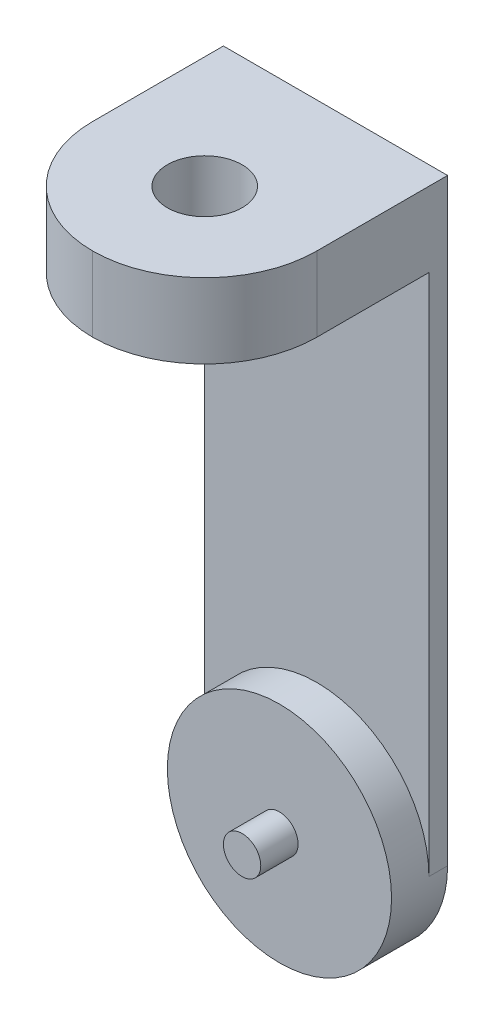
ISO-10303-21;
HEADER;
FILE_DESCRIPTION(('STEP AP214'),'2;1');
FILE_NAME('part.step','',(''),(''),'','','');
FILE_SCHEMA(('AUTOMOTIVE_DESIGN { 1 0 10303 214 1 1 1 1 }'));
ENDSEC;
DATA;
#1=APPLICATION_CONTEXT('core data for automotive mechanical design processes');
#2=APPLICATION_PROTOCOL_DEFINITION('international standard','automotive_design',2000,#1);
#3=PRODUCT_CONTEXT('',#1,'mechanical');
#4=PRODUCT('Part','Part','',(#3));
#5=PRODUCT_RELATED_PRODUCT_CATEGORY('part','',(#4));
#6=PRODUCT_DEFINITION_FORMATION('','',#4);
#7=PRODUCT_DEFINITION_CONTEXT('part definition',#1,'design');
#8=PRODUCT_DEFINITION('design','',#6,#7);
#9=PRODUCT_DEFINITION_SHAPE('','',#8);
#10=(LENGTH_UNIT() NAMED_UNIT(*) SI_UNIT(.MILLI.,.METRE.));
#11=(NAMED_UNIT(*) PLANE_ANGLE_UNIT() SI_UNIT($,.RADIAN.));
#12=(NAMED_UNIT(*) SI_UNIT($,.STERADIAN.) SOLID_ANGLE_UNIT());
#13=UNCERTAINTY_MEASURE_WITH_UNIT(LENGTH_MEASURE(1.E-05),#10,'distance_accuracy_value','');
#14=(GEOMETRIC_REPRESENTATION_CONTEXT(3) GLOBAL_UNCERTAINTY_ASSIGNED_CONTEXT((#13)) GLOBAL_UNIT_ASSIGNED_CONTEXT((#10,
#11,#12)) REPRESENTATION_CONTEXT('',''));
#15=CARTESIAN_POINT('',(0.,0.,0.));
#16=DIRECTION('',(0.,0.,1.));
#17=DIRECTION('',(1.,0.,0.));
#18=AXIS2_PLACEMENT_3D('',#15,#16,#17);
#19=CARTESIAN_POINT('',(0.,0.,5.));
#20=DIRECTION('',(0.,0.,-1.));
#21=DIRECTION('',(-1.,0.,0.));
#22=AXIS2_PLACEMENT_3D('',#19,#20,#21);
#23=PLANE('',#22);
#24=DIRECTION('',(-1.,0.,0.));
#25=VECTOR('',#24,1.);
#26=CARTESIAN_POINT('',(0.,140.,5.));
#27=LINE('',#26,#25);
#28=CARTESIAN_POINT('',(60.,140.,5.));
#29=VERTEX_POINT('',#28);
#30=CARTESIAN_POINT('',(0.,140.,5.));
#31=VERTEX_POINT('',#30);
#32=EDGE_CURVE('E125',#29,#31,#27,.T.);
#33=ORIENTED_EDGE('',*,*,#32,.T.);
#34=DIRECTION('',(0.,-1.,0.));
#35=VECTOR('',#34,1.);
#36=CARTESIAN_POINT('',(0.,0.,5.));
#37=LINE('',#36,#35);
#38=CARTESIAN_POINT('',(0.,0.,5.));
#39=VERTEX_POINT('',#38);
#40=EDGE_CURVE('E115',#31,#39,#37,.T.);
#41=ORIENTED_EDGE('',*,*,#40,.T.);
#42=CARTESIAN_POINT('',(30.,0.,5.));
#43=DIRECTION('',(0.,0.,1.));
#44=DIRECTION('',(1.,0.,0.));
#45=AXIS2_PLACEMENT_3D('',#42,#43,#44);
#46=CIRCLE('',#45,30.);
#47=CARTESIAN_POINT('',(60.,0.,5.));
#48=VERTEX_POINT('',#47);
#49=EDGE_CURVE('E98',#48,#39,#46,.T.);
#50=ORIENTED_EDGE('',*,*,#49,.F.);
#51=DIRECTION('',(0.,1.,0.));
#52=VECTOR('',#51,1.);
#53=CARTESIAN_POINT('',(60.,0.,5.));
#54=LINE('',#53,#52);
#55=EDGE_CURVE('E107',#48,#29,#54,.T.);
#56=ORIENTED_EDGE('',*,*,#55,.T.);
#57=EDGE_LOOP('',(#33,#41,#50,#56));
#58=FACE_BOUND('',#57,.T.);
#59=ADVANCED_FACE('F33',(#58),#23,.F.);
#60=CARTESIAN_POINT('',(0.,0.,5.));
#61=DIRECTION('',(1.,0.,0.));
#62=DIRECTION('',(0.,0.,-1.));
#63=AXIS2_PLACEMENT_3D('',#60,#61,#62);
#64=PLANE('',#63);
#65=DIRECTION('',(0.,0.,1.));
#66=VECTOR('',#65,1.);
#67=CARTESIAN_POINT('',(0.,140.,5.));
#68=LINE('',#67,#66);
#69=CARTESIAN_POINT('',(0.,140.,35.));
#70=VERTEX_POINT('',#69);
#71=EDGE_CURVE('E152',#31,#70,#68,.T.);
#72=ORIENTED_EDGE('',*,*,#71,.T.);
#73=DIRECTION('',(0.,1.,0.));
#74=VECTOR('',#73,1.);
#75=CARTESIAN_POINT('',(0.,160.,35.));
#76=LINE('',#75,#74);
#77=CARTESIAN_POINT('',(0.,160.,35.));
#78=VERTEX_POINT('',#77);
#79=EDGE_CURVE('E41',#70,#78,#76,.T.);
#80=ORIENTED_EDGE('',*,*,#79,.T.);
#81=DIRECTION('',(0.,0.,-1.));
#82=VECTOR('',#81,1.);
#83=CARTESIAN_POINT('',(0.,160.,5.));
#84=LINE('',#83,#82);
#85=CARTESIAN_POINT('',(0.,160.,0.));
#86=VERTEX_POINT('',#85);
#87=EDGE_CURVE('E114',#78,#86,#84,.T.);
#88=ORIENTED_EDGE('',*,*,#87,.T.);
#89=DIRECTION('',(0.,-1.,0.));
#90=VECTOR('',#89,1.);
#91=CARTESIAN_POINT('',(0.,0.,0.));
#92=LINE('',#91,#90);
#93=CARTESIAN_POINT('',(0.,0.,0.));
#94=VERTEX_POINT('',#93);
#95=EDGE_CURVE('E130',#86,#94,#92,.T.);
#96=ORIENTED_EDGE('',*,*,#95,.T.);
#97=DIRECTION('',(0.,0.,-1.));
#98=VECTOR('',#97,1.);
#99=CARTESIAN_POINT('',(0.,0.,5.));
#100=LINE('',#99,#98);
#101=EDGE_CURVE('E103',#39,#94,#100,.T.);
#102=ORIENTED_EDGE('',*,*,#101,.F.);
#103=ORIENTED_EDGE('',*,*,#40,.F.);
#104=EDGE_LOOP('',(#72,#80,#88,#96,#102,#103));
#105=FACE_BOUND('',#104,.T.);
#106=ADVANCED_FACE('F190',(#105),#64,.F.);
#107=CARTESIAN_POINT('',(60.,0.,5.));
#108=DIRECTION('',(-1.,0.,0.));
#109=DIRECTION('',(0.,0.,1.));
#110=AXIS2_PLACEMENT_3D('',#107,#108,#109);
#111=PLANE('',#110);
#112=DIRECTION('',(0.,0.,-1.));
#113=VECTOR('',#112,1.);
#114=CARTESIAN_POINT('',(60.,160.,5.));
#115=LINE('',#114,#113);
#116=CARTESIAN_POINT('',(60.,160.,35.));
#117=VERTEX_POINT('',#116);
#118=CARTESIAN_POINT('',(60.,160.,0.));
#119=VERTEX_POINT('',#118);
#120=EDGE_CURVE('E104',#117,#119,#115,.T.);
#121=ORIENTED_EDGE('',*,*,#120,.F.);
#122=DIRECTION('',(0.,1.,0.));
#123=VECTOR('',#122,1.);
#124=CARTESIAN_POINT('',(60.,140.,35.));
#125=LINE('',#124,#123);
#126=CARTESIAN_POINT('',(60.,140.,35.));
#127=VERTEX_POINT('',#126);
#128=EDGE_CURVE('E146',#117,#127,#125,.F.);
#129=ORIENTED_EDGE('',*,*,#128,.T.);
#130=DIRECTION('',(0.,0.,-1.));
#131=VECTOR('',#130,1.);
#132=CARTESIAN_POINT('',(60.,140.,5.));
#133=LINE('',#132,#131);
#134=EDGE_CURVE('E111',#127,#29,#133,.T.);
#135=ORIENTED_EDGE('',*,*,#134,.T.);
#136=ORIENTED_EDGE('',*,*,#55,.F.);
#137=DIRECTION('',(0.,0.,-1.));
#138=VECTOR('',#137,1.);
#139=CARTESIAN_POINT('',(60.,0.,5.));
#140=LINE('',#139,#138);
#141=CARTESIAN_POINT('',(60.,0.,0.));
#142=VERTEX_POINT('',#141);
#143=EDGE_CURVE('E92',#48,#142,#140,.T.);
#144=ORIENTED_EDGE('',*,*,#143,.T.);
#145=DIRECTION('',(0.,1.,0.));
#146=VECTOR('',#145,1.);
#147=CARTESIAN_POINT('',(60.,0.,0.));
#148=LINE('',#147,#146);
#149=EDGE_CURVE('E134',#142,#119,#148,.T.);
#150=ORIENTED_EDGE('',*,*,#149,.T.);
#151=EDGE_LOOP('',(#121,#129,#135,#136,#144,#150));
#152=FACE_BOUND('',#151,.T.);
#153=ADVANCED_FACE('F109',(#152),#111,.F.);
#154=CARTESIAN_POINT('',(0.,160.,5.));
#155=DIRECTION('',(0.,-1.,0.));
#156=DIRECTION('',(0.,0.,-1.));
#157=AXIS2_PLACEMENT_3D('',#154,#155,#156);
#158=PLANE('',#157);
#159=CARTESIAN_POINT('',(30.,160.,35.));
#160=DIRECTION('',(0.,1.,0.));
#161=DIRECTION('',(0.,0.,1.));
#162=AXIS2_PLACEMENT_3D('',#159,#160,#161);
#163=CIRCLE('',#162,10.);
#164=CARTESIAN_POINT('',(30.,160.,45.));
#165=VERTEX_POINT('',#164);
#166=EDGE_CURVE('E159',#165,#165,#163,.T.);
#167=ORIENTED_EDGE('',*,*,#166,.F.);
#168=EDGE_LOOP('',(#167));
#169=FACE_BOUND('',#168,.T.);
#170=CARTESIAN_POINT('',(30.,160.,35.));
#171=DIRECTION('',(0.,-1.,0.));
#172=DIRECTION('',(0.,0.,-1.));
#173=AXIS2_PLACEMENT_3D('',#170,#171,#172);
#174=CIRCLE('',#173,30.);
#175=CARTESIAN_POINT('',(30.,160.,65.));
#176=VERTEX_POINT('',#175);
#177=EDGE_CURVE('E142',#78,#176,#174,.F.);
#178=ORIENTED_EDGE('',*,*,#177,.T.);
#179=CARTESIAN_POINT('',(30.,160.,35.));
#180=DIRECTION('',(0.,-1.,0.));
#181=DIRECTION('',(0.,0.,-1.));
#182=AXIS2_PLACEMENT_3D('',#179,#180,#181);
#183=CIRCLE('',#182,30.);
#184=EDGE_CURVE('E144',#176,#117,#183,.F.);
#185=ORIENTED_EDGE('',*,*,#184,.T.);
#186=ORIENTED_EDGE('',*,*,#120,.T.);
#187=DIRECTION('',(-1.,0.,0.));
#188=VECTOR('',#187,1.);
#189=CARTESIAN_POINT('',(0.,160.,0.));
#190=LINE('',#189,#188);
#191=EDGE_CURVE('E131',#119,#86,#190,.T.);
#192=ORIENTED_EDGE('',*,*,#191,.T.);
#193=ORIENTED_EDGE('',*,*,#87,.F.);
#194=EDGE_LOOP('',(#178,#185,#186,#192,#193));
#195=FACE_BOUND('',#194,.T.);
#196=ADVANCED_FACE('F185',(#169,#195),#158,.F.);
#197=CARTESIAN_POINT('',(0.,0.,0.));
#198=DIRECTION('',(0.,0.,-1.));
#199=DIRECTION('',(-1.,0.,0.));
#200=AXIS2_PLACEMENT_3D('',#197,#198,#199);
#201=PLANE('',#200);
#202=ORIENTED_EDGE('',*,*,#95,.F.);
#203=ORIENTED_EDGE('',*,*,#191,.F.);
#204=ORIENTED_EDGE('',*,*,#149,.F.);
#205=CARTESIAN_POINT('',(30.,0.,0.));
#206=DIRECTION('',(0.,0.,1.));
#207=DIRECTION('',(1.,0.,0.));
#208=AXIS2_PLACEMENT_3D('',#205,#206,#207);
#209=CIRCLE('',#208,30.);
#210=EDGE_CURVE('E100',#94,#142,#209,.T.);
#211=ORIENTED_EDGE('',*,*,#210,.F.);
#212=EDGE_LOOP('',(#202,#203,#204,#211));
#213=FACE_BOUND('',#212,.T.);
#214=ADVANCED_FACE('F180',(#213),#201,.T.);
#215=CARTESIAN_POINT('',(30.,0.,5.));
#216=DIRECTION('',(0.,0.,-1.));
#217=DIRECTION('',(-1.,0.,0.));
#218=AXIS2_PLACEMENT_3D('',#215,#216,#217);
#219=CYLINDRICAL_SURFACE('',#218,30.);
#220=ORIENTED_EDGE('',*,*,#210,.T.);
#221=ORIENTED_EDGE('',*,*,#143,.F.);
#222=ORIENTED_EDGE('',*,*,#49,.T.);
#223=ORIENTED_EDGE('',*,*,#101,.T.);
#224=EDGE_LOOP('',(#220,#221,#222,#223));
#225=FACE_BOUND('',#224,.T.);
#226=CARTESIAN_POINT('',(30.,0.,15.));
#227=DIRECTION('',(0.,0.,1.));
#228=DIRECTION('',(1.,0.,0.));
#229=AXIS2_PLACEMENT_3D('',#226,#227,#228);
#230=CIRCLE('',#229,30.);
#231=CARTESIAN_POINT('',(60.,0.,15.));
#232=VERTEX_POINT('',#231);
#233=EDGE_CURVE('E119',#232,#232,#230,.T.);
#234=ORIENTED_EDGE('',*,*,#233,.F.);
#235=EDGE_LOOP('',(#234));
#236=FACE_BOUND('',#235,.T.);
#237=ADVANCED_FACE('F94',(#225,#236),#219,.T.);
#238=CARTESIAN_POINT('',(30.,0.,15.));
#239=DIRECTION('',(0.,0.,1.));
#240=DIRECTION('',(1.,0.,0.));
#241=AXIS2_PLACEMENT_3D('',#238,#239,#240);
#242=PLANE('',#241);
#243=CARTESIAN_POINT('',(30.,0.,15.));
#244=DIRECTION('',(0.,0.,1.));
#245=DIRECTION('',(1.,0.,0.));
#246=AXIS2_PLACEMENT_3D('',#243,#244,#245);
#247=CIRCLE('',#246,5.);
#248=CARTESIAN_POINT('',(35.,0.,15.));
#249=VERTEX_POINT('',#248);
#250=EDGE_CURVE('E141',#249,#249,#247,.T.);
#251=ORIENTED_EDGE('',*,*,#250,.F.);
#252=EDGE_LOOP('',(#251));
#253=FACE_BOUND('',#252,.T.);
#254=ORIENTED_EDGE('',*,*,#233,.T.);
#255=EDGE_LOOP('',(#254));
#256=FACE_BOUND('',#255,.T.);
#257=ADVANCED_FACE('F174',(#253,#256),#242,.T.);
#258=CARTESIAN_POINT('',(30.,0.,25.));
#259=DIRECTION('',(0.,0.,-1.));
#260=DIRECTION('',(-1.,0.,0.));
#261=AXIS2_PLACEMENT_3D('',#258,#259,#260);
#262=CYLINDRICAL_SURFACE('',#261,5.);
#263=CARTESIAN_POINT('',(30.,0.,25.));
#264=DIRECTION('',(0.,0.,1.));
#265=DIRECTION('',(1.,0.,0.));
#266=AXIS2_PLACEMENT_3D('',#263,#264,#265);
#267=CIRCLE('',#266,5.);
#268=CARTESIAN_POINT('',(35.,0.,25.));
#269=VERTEX_POINT('',#268);
#270=EDGE_CURVE('E120',#269,#269,#267,.T.);
#271=ORIENTED_EDGE('',*,*,#270,.F.);
#272=EDGE_LOOP('',(#271));
#273=FACE_BOUND('',#272,.T.);
#274=ORIENTED_EDGE('',*,*,#250,.T.);
#275=EDGE_LOOP('',(#274));
#276=FACE_BOUND('',#275,.T.);
#277=ADVANCED_FACE('F172',(#273,#276),#262,.T.);
#278=CARTESIAN_POINT('',(30.,0.,25.));
#279=DIRECTION('',(0.,0.,1.));
#280=DIRECTION('',(1.,0.,0.));
#281=AXIS2_PLACEMENT_3D('',#278,#279,#280);
#282=PLANE('',#281);
#283=ORIENTED_EDGE('',*,*,#270,.T.);
#284=EDGE_LOOP('',(#283));
#285=FACE_BOUND('',#284,.T.);
#286=ADVANCED_FACE('F221',(#285),#282,.T.);
#287=CARTESIAN_POINT('',(0.,140.,0.));
#288=DIRECTION('',(0.,1.,0.));
#289=DIRECTION('',(0.,0.,1.));
#290=AXIS2_PLACEMENT_3D('',#287,#288,#289);
#291=PLANE('',#290);
#292=CARTESIAN_POINT('',(30.,140.,55.));
#293=DIRECTION('',(0.,1.,0.));
#294=DIRECTION('',(0.,0.,1.));
#295=AXIS2_PLACEMENT_3D('',#292,#293,#294);
#296=CIRCLE('',#295,2.5);
#297=CARTESIAN_POINT('',(30.,140.,57.5));
#298=VERTEX_POINT('',#297);
#299=EDGE_CURVE('E11',#298,#298,#296,.F.);
#300=ORIENTED_EDGE('',*,*,#299,.F.);
#301=EDGE_LOOP('',(#300));
#302=FACE_BOUND('',#301,.T.);
#303=CARTESIAN_POINT('',(30.,140.,35.));
#304=DIRECTION('',(0.,1.,0.));
#305=DIRECTION('',(0.,0.,1.));
#306=AXIS2_PLACEMENT_3D('',#303,#304,#305);
#307=CIRCLE('',#306,10.);
#308=CARTESIAN_POINT('',(30.,140.,45.));
#309=VERTEX_POINT('',#308);
#310=EDGE_CURVE('E153',#309,#309,#307,.F.);
#311=ORIENTED_EDGE('',*,*,#310,.F.);
#312=EDGE_LOOP('',(#311));
#313=FACE_BOUND('',#312,.T.);
#314=ORIENTED_EDGE('',*,*,#134,.F.);
#315=CARTESIAN_POINT('',(30.,140.,35.));
#316=DIRECTION('',(0.,1.,0.));
#317=DIRECTION('',(0.,0.,1.));
#318=AXIS2_PLACEMENT_3D('',#315,#316,#317);
#319=CIRCLE('',#318,30.);
#320=CARTESIAN_POINT('',(30.,140.,65.));
#321=VERTEX_POINT('',#320);
#322=EDGE_CURVE('E48',#127,#321,#319,.F.);
#323=ORIENTED_EDGE('',*,*,#322,.T.);
#324=CARTESIAN_POINT('',(30.,140.,35.));
#325=DIRECTION('',(0.,1.,0.));
#326=DIRECTION('',(0.,0.,1.));
#327=AXIS2_PLACEMENT_3D('',#324,#325,#326);
#328=CIRCLE('',#327,30.);
#329=EDGE_CURVE('E52',#321,#70,#328,.F.);
#330=ORIENTED_EDGE('',*,*,#329,.T.);
#331=ORIENTED_EDGE('',*,*,#71,.F.);
#332=ORIENTED_EDGE('',*,*,#32,.F.);
#333=EDGE_LOOP('',(#314,#323,#330,#331,#332));
#334=FACE_BOUND('',#333,.T.);
#335=ADVANCED_FACE('F211',(#302,#313,#334),#291,.F.);
#336=CARTESIAN_POINT('',(30.,0.,35.));
#337=DIRECTION('',(0.,-1.,0.));
#338=DIRECTION('',(0.,0.,-1.));
#339=AXIS2_PLACEMENT_3D('',#336,#337,#338);
#340=CYLINDRICAL_SURFACE('',#339,30.);
#341=ORIENTED_EDGE('',*,*,#79,.F.);
#342=ORIENTED_EDGE('',*,*,#329,.F.);
#343=DIRECTION('',(0.,1.,0.));
#344=VECTOR('',#343,1.);
#345=CARTESIAN_POINT('',(30.,140.,65.));
#346=LINE('',#345,#344);
#347=EDGE_CURVE('E150',#176,#321,#346,.F.);
#348=ORIENTED_EDGE('',*,*,#347,.F.);
#349=ORIENTED_EDGE('',*,*,#177,.F.);
#350=EDGE_LOOP('',(#341,#342,#348,#349));
#351=FACE_BOUND('',#350,.T.);
#352=ADVANCED_FACE('F35',(#351),#340,.T.);
#353=CARTESIAN_POINT('',(30.,140.,35.));
#354=DIRECTION('',(0.,-1.,0.));
#355=DIRECTION('',(0.,0.,-1.));
#356=AXIS2_PLACEMENT_3D('',#353,#354,#355);
#357=CYLINDRICAL_SURFACE('',#356,30.);
#358=ORIENTED_EDGE('',*,*,#322,.F.);
#359=ORIENTED_EDGE('',*,*,#128,.F.);
#360=ORIENTED_EDGE('',*,*,#184,.F.);
#361=ORIENTED_EDGE('',*,*,#347,.T.);
#362=EDGE_LOOP('',(#358,#359,#360,#361));
#363=FACE_BOUND('',#362,.T.);
#364=ADVANCED_FACE('F201',(#363),#357,.T.);
#365=CARTESIAN_POINT('',(30.,-30.001,35.));
#366=DIRECTION('',(0.,1.,0.));
#367=DIRECTION('',(0.,0.,1.));
#368=AXIS2_PLACEMENT_3D('',#365,#366,#367);
#369=CYLINDRICAL_SURFACE('',#368,10.);
#370=CARTESIAN_POINT('',(30.,160.,45.));
#371=CARTESIAN_POINT('',(30.,159.791666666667,45.));
#372=CARTESIAN_POINT('',(30.,159.583333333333,45.));
#373=CARTESIAN_POINT('',(30.,159.166666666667,45.));
#374=CARTESIAN_POINT('',(30.,158.958333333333,45.));
#375=CARTESIAN_POINT('',(30.,158.541666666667,45.));
#376=CARTESIAN_POINT('',(30.,158.333333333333,45.));
#377=CARTESIAN_POINT('',(30.,157.916666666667,45.));
#378=CARTESIAN_POINT('',(30.,157.708333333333,45.));
#379=CARTESIAN_POINT('',(30.,157.291666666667,45.));
#380=CARTESIAN_POINT('',(30.,157.083333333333,45.));
#381=CARTESIAN_POINT('',(30.,156.666666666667,45.));
#382=CARTESIAN_POINT('',(30.,156.458333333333,45.));
#383=CARTESIAN_POINT('',(30.,156.041666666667,45.));
#384=CARTESIAN_POINT('',(30.,155.833333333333,45.));
#385=CARTESIAN_POINT('',(30.,155.416666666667,45.));
#386=CARTESIAN_POINT('',(30.,155.208333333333,45.));
#387=CARTESIAN_POINT('',(30.,154.791666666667,45.));
#388=CARTESIAN_POINT('',(30.,154.583333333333,45.));
#389=CARTESIAN_POINT('',(30.,154.166666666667,45.));
#390=CARTESIAN_POINT('',(30.,153.958333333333,45.));
#391=CARTESIAN_POINT('',(30.,153.541666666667,45.));
#392=CARTESIAN_POINT('',(30.,153.333333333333,45.));
#393=CARTESIAN_POINT('',(30.,152.916666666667,45.));
#394=CARTESIAN_POINT('',(30.,152.708333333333,45.));
#395=CARTESIAN_POINT('',(30.,152.291666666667,45.));
#396=CARTESIAN_POINT('',(30.,152.083333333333,45.));
#397=CARTESIAN_POINT('',(30.,151.666666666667,45.));
#398=CARTESIAN_POINT('',(30.,151.458333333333,45.));
#399=CARTESIAN_POINT('',(30.,151.041666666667,45.));
#400=CARTESIAN_POINT('',(30.,150.833333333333,45.));
#401=CARTESIAN_POINT('',(30.,150.416666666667,45.));
#402=CARTESIAN_POINT('',(30.,150.208333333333,45.));
#403=CARTESIAN_POINT('',(30.,149.791666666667,45.));
#404=CARTESIAN_POINT('',(30.,149.583333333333,45.));
#405=CARTESIAN_POINT('',(30.,149.166666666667,45.));
#406=CARTESIAN_POINT('',(30.,148.958333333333,45.));
#407=CARTESIAN_POINT('',(30.,148.541666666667,45.));
#408=CARTESIAN_POINT('',(30.,148.333333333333,45.));
#409=CARTESIAN_POINT('',(30.,147.916666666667,45.));
#410=CARTESIAN_POINT('',(30.,147.708333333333,45.));
#411=CARTESIAN_POINT('',(30.,147.291666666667,45.));
#412=CARTESIAN_POINT('',(30.,147.083333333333,45.));
#413=CARTESIAN_POINT('',(30.,146.666666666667,45.));
#414=CARTESIAN_POINT('',(30.,146.458333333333,45.));
#415=CARTESIAN_POINT('',(30.,146.041666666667,45.));
#416=CARTESIAN_POINT('',(30.,145.833333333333,45.));
#417=CARTESIAN_POINT('',(30.,145.416666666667,45.));
#418=CARTESIAN_POINT('',(30.,145.208333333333,45.));
#419=CARTESIAN_POINT('',(30.,144.791666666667,45.));
#420=CARTESIAN_POINT('',(30.,144.583333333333,45.));
#421=CARTESIAN_POINT('',(30.,144.166666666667,45.));
#422=CARTESIAN_POINT('',(30.,143.958333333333,45.));
#423=CARTESIAN_POINT('',(30.,143.541666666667,45.));
#424=CARTESIAN_POINT('',(30.,143.333333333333,45.));
#425=CARTESIAN_POINT('',(30.,142.916666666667,45.));
#426=CARTESIAN_POINT('',(30.,142.708333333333,45.));
#427=CARTESIAN_POINT('',(30.,142.291666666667,45.));
#428=CARTESIAN_POINT('',(30.,142.083333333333,45.));
#429=CARTESIAN_POINT('',(30.,141.666666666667,45.));
#430=CARTESIAN_POINT('',(30.,141.458333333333,45.));
#431=CARTESIAN_POINT('',(30.,141.041666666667,45.));
#432=CARTESIAN_POINT('',(30.,140.833333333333,45.));
#433=CARTESIAN_POINT('',(30.,140.416666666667,45.));
#434=CARTESIAN_POINT('',(30.,140.208333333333,45.));
#435=CARTESIAN_POINT('',(30.,140.,45.));
#436=B_SPLINE_CURVE_WITH_KNOTS('',3,(#370,#371,#372,#373,#374,#375,#376,#377,#378,#379,#380,
#381,#382,#383,#384,#385,#386,#387,#388,#389,#390,#391,#392,#393,#394,#395,#396,#397,#398,#399,
#400,#401,#402,#403,#404,#405,#406,#407,#408,#409,#410,#411,#412,#413,#414,#415,#416,#417,#418,
#419,#420,#421,#422,#423,#424,#425,#426,#427,#428,#429,#430,#431,#432,#433,#434,#435),
.UNSPECIFIED.,.F.,.F.,(4,2,2,2,2,2,2,2,2,2,2,2,2,2,2,2,2,2,2,2,2,2,2,2,2,2,2,2,2,2,2,2,4),(0.,
0.624999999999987,1.25,1.87500000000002,2.5,3.12499999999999,3.75,4.37500000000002,5.,
5.62499999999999,6.25000000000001,6.87500000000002,7.50000000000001,8.12499999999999,
8.75000000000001,9.37500000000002,10.,10.625,11.25,11.875,12.5,13.125,13.75,14.375,15.,15.625,
16.25,16.875,17.5,18.125,18.75,19.375,20.),.UNSPECIFIED.);
#437=EDGE_CURVE('BSEAM203',#165,#309,#436,.T.);
#438=ORIENTED_EDGE('',*,*,#166,.T.);
#439=ORIENTED_EDGE('',*,*,#310,.T.);
#440=ORIENTED_EDGE('',*,*,#437,.T.);
#441=ORIENTED_EDGE('',*,*,#437,.F.);
#442=EDGE_LOOP('',(#438,#440,#439,#441));
#443=FACE_BOUND('',#442,.T.);
#444=ADVANCED_FACE('F203',(#443),#369,.F.);
#445=CARTESIAN_POINT('',(30.,135.,55.));
#446=DIRECTION('',(0.,1.,0.));
#447=DIRECTION('',(0.,0.,1.));
#448=AXIS2_PLACEMENT_3D('',#445,#446,#447);
#449=CYLINDRICAL_SURFACE('',#448,2.5);
#450=CARTESIAN_POINT('',(30.,135.,55.));
#451=DIRECTION('',(0.,-1.,0.));
#452=DIRECTION('',(0.,0.,-1.));
#453=AXIS2_PLACEMENT_3D('',#450,#451,#452);
#454=CIRCLE('',#453,2.5);
#455=CARTESIAN_POINT('',(30.,135.,52.5));
#456=VERTEX_POINT('',#455);
#457=EDGE_CURVE('E164',#456,#456,#454,.T.);
#458=ORIENTED_EDGE('',*,*,#457,.F.);
#459=EDGE_LOOP('',(#458));
#460=FACE_BOUND('',#459,.T.);
#461=ORIENTED_EDGE('',*,*,#299,.T.);
#462=EDGE_LOOP('',(#461));
#463=FACE_BOUND('',#462,.T.);
#464=ADVANCED_FACE('F208',(#460,#463),#449,.T.);
#465=CARTESIAN_POINT('',(30.,135.,55.));
#466=DIRECTION('',(0.,-1.,0.));
#467=DIRECTION('',(0.,0.,-1.));
#468=AXIS2_PLACEMENT_3D('',#465,#466,#467);
#469=PLANE('',#468);
#470=ORIENTED_EDGE('',*,*,#457,.T.);
#471=EDGE_LOOP('',(#470));
#472=FACE_BOUND('',#471,.T.);
#473=ADVANCED_FACE('F282',(#472),#469,.T.);
#474=CLOSED_SHELL('',(#59,#106,#153,#196,#214,#237,#257,#277,#286,#335,#352,#364,#444,#464,#473));
#475=MANIFOLD_SOLID_BREP('B2',#474);
#476=ADVANCED_BREP_SHAPE_REPRESENTATION('',(#18,#475),#14);
#477=SHAPE_DEFINITION_REPRESENTATION(#9,#476);
ENDSEC;
END-ISO-10303-21;
